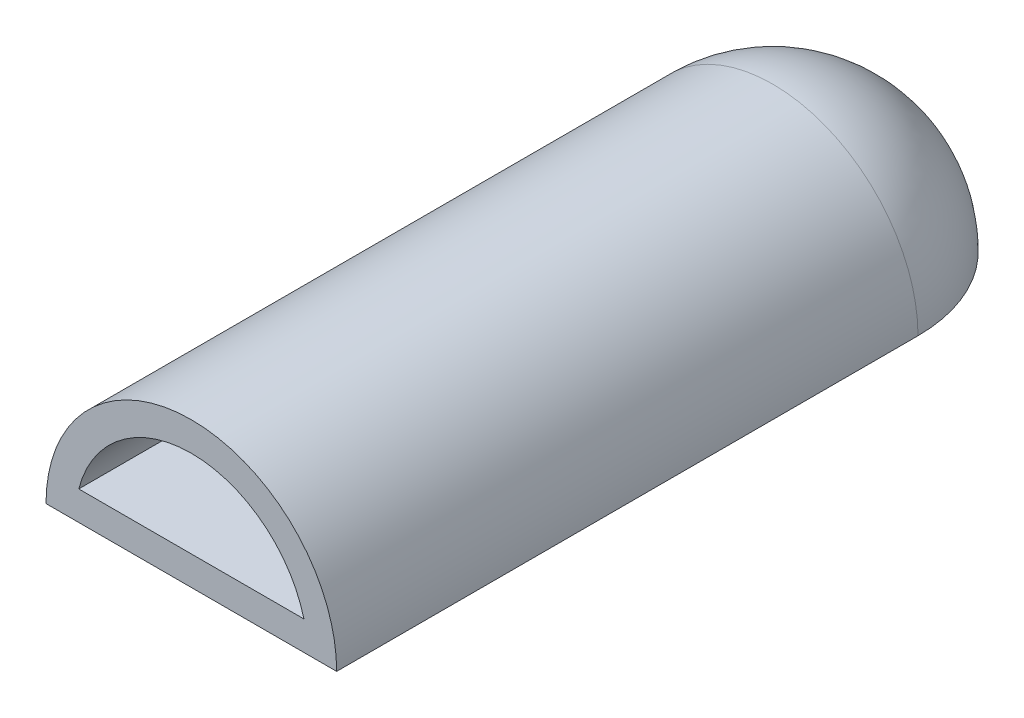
ISO-10303-21;
HEADER;
FILE_DESCRIPTION(('STEP AP214'),'2;1');
FILE_NAME('part.step','',(''),(''),'','','');
FILE_SCHEMA(('AUTOMOTIVE_DESIGN { 1 0 10303 214 1 1 1 1 }'));
ENDSEC;
DATA;
#1=APPLICATION_CONTEXT('core data for automotive mechanical design processes');
#2=APPLICATION_PROTOCOL_DEFINITION('international standard','automotive_design',2000,#1);
#3=PRODUCT_CONTEXT('',#1,'mechanical');
#4=PRODUCT('Part','Part','',(#3));
#5=PRODUCT_RELATED_PRODUCT_CATEGORY('part','',(#4));
#6=PRODUCT_DEFINITION_FORMATION('','',#4);
#7=PRODUCT_DEFINITION_CONTEXT('part definition',#1,'design');
#8=PRODUCT_DEFINITION('design','',#6,#7);
#9=PRODUCT_DEFINITION_SHAPE('','',#8);
#10=(LENGTH_UNIT() NAMED_UNIT(*) SI_UNIT(.MILLI.,.METRE.));
#11=(NAMED_UNIT(*) PLANE_ANGLE_UNIT() SI_UNIT($,.RADIAN.));
#12=(NAMED_UNIT(*) SI_UNIT($,.STERADIAN.) SOLID_ANGLE_UNIT());
#13=UNCERTAINTY_MEASURE_WITH_UNIT(LENGTH_MEASURE(1.E-05),#10,'distance_accuracy_value','');
#14=(GEOMETRIC_REPRESENTATION_CONTEXT(3) GLOBAL_UNCERTAINTY_ASSIGNED_CONTEXT((#13)) GLOBAL_UNIT_ASSIGNED_CONTEXT((#10,
#11,#12)) REPRESENTATION_CONTEXT('',''));
#15=CARTESIAN_POINT('',(0.,0.,0.));
#16=DIRECTION('',(0.,0.,1.));
#17=DIRECTION('',(1.,0.,0.));
#18=AXIS2_PLACEMENT_3D('',#15,#16,#17);
#19=CARTESIAN_POINT('',(0.,0.,100.));
#20=DIRECTION('',(0.,0.,-1.));
#21=DIRECTION('',(-1.,0.,0.));
#22=AXIS2_PLACEMENT_3D('',#19,#20,#21);
#23=PLANE('',#22);
#24=CARTESIAN_POINT('',(0.,0.,100.));
#25=DIRECTION('',(0.,0.,1.));
#26=DIRECTION('',(-1.,0.,0.));
#27=AXIS2_PLACEMENT_3D('',#24,#25,#26);
#28=CIRCLE('',#27,20.);
#29=CARTESIAN_POINT('',(20.,0.,100.));
#30=VERTEX_POINT('',#29);
#31=CARTESIAN_POINT('',(-20.,0.,100.));
#32=VERTEX_POINT('',#31);
#33=EDGE_CURVE('E87',#30,#32,#28,.T.);
#34=ORIENTED_EDGE('',*,*,#33,.T.);
#35=DIRECTION('',(1.,0.,0.));
#36=VECTOR('',#35,1.);
#37=CARTESIAN_POINT('',(-20.,0.,100.));
#38=LINE('',#37,#36);
#39=EDGE_CURVE('E112',#32,#30,#38,.T.);
#40=ORIENTED_EDGE('',*,*,#39,.T.);
#41=EDGE_LOOP('',(#34,#40));
#42=FACE_BOUND('',#41,.T.);
#43=CARTESIAN_POINT('',(0.,0.,100.));
#44=DIRECTION('',(0.,0.,-1.));
#45=DIRECTION('',(-1.,0.,0.));
#46=AXIS2_PLACEMENT_3D('',#43,#44,#45);
#47=CIRCLE('',#46,16.);
#48=CARTESIAN_POINT('',(15.4919333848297,4.,100.));
#49=VERTEX_POINT('',#48);
#50=CARTESIAN_POINT('',(-15.4919333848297,4.,100.));
#51=VERTEX_POINT('',#50);
#52=EDGE_CURVE('E104',#49,#51,#47,.F.);
#53=ORIENTED_EDGE('',*,*,#52,.F.);
#54=DIRECTION('',(1.,0.,0.));
#55=VECTOR('',#54,1.);
#56=CARTESIAN_POINT('',(0.,4.,100.));
#57=LINE('',#56,#55);
#58=EDGE_CURVE('E93',#51,#49,#57,.T.);
#59=ORIENTED_EDGE('',*,*,#58,.F.);
#60=EDGE_LOOP('',(#53,#59));
#61=FACE_BOUND('',#60,.T.);
#62=ADVANCED_FACE('F39',(#42,#61),#23,.F.);
#63=CARTESIAN_POINT('',(0.,0.,100.));
#64=DIRECTION('',(0.,0.,-1.));
#65=DIRECTION('',(-1.,0.,0.));
#66=AXIS2_PLACEMENT_3D('',#63,#64,#65);
#67=CYLINDRICAL_SURFACE('',#66,20.);
#68=DIRECTION('',(0.,0.,-1.));
#69=VECTOR('',#68,1.);
#70=CARTESIAN_POINT('',(20.,0.,100.));
#71=LINE('',#70,#69);
#72=CARTESIAN_POINT('',(20.,0.,20.));
#73=VERTEX_POINT('',#72);
#74=EDGE_CURVE('E115',#30,#73,#71,.T.);
#75=ORIENTED_EDGE('',*,*,#74,.T.);
#76=CARTESIAN_POINT('',(0.,0.,20.));
#77=DIRECTION('',(0.,0.,-1.));
#78=DIRECTION('',(-1.,0.,0.));
#79=AXIS2_PLACEMENT_3D('',#76,#77,#78);
#80=CIRCLE('',#79,20.);
#81=CARTESIAN_POINT('',(-20.,0.,20.));
#82=VERTEX_POINT('',#81);
#83=EDGE_CURVE('E122',#73,#82,#80,.F.);
#84=ORIENTED_EDGE('',*,*,#83,.T.);
#85=DIRECTION('',(0.,0.,-1.));
#86=VECTOR('',#85,1.);
#87=CARTESIAN_POINT('',(-20.,0.,100.));
#88=LINE('',#87,#86);
#89=EDGE_CURVE('E119',#32,#82,#88,.T.);
#90=ORIENTED_EDGE('',*,*,#89,.F.);
#91=ORIENTED_EDGE('',*,*,#33,.F.);
#92=EDGE_LOOP('',(#75,#84,#90,#91));
#93=FACE_BOUND('',#92,.T.);
#94=ADVANCED_FACE('F132',(#93),#67,.T.);
#95=CARTESIAN_POINT('',(-20.,0.,100.));
#96=DIRECTION('',(0.,1.,0.));
#97=DIRECTION('',(0.,0.,1.));
#98=AXIS2_PLACEMENT_3D('',#95,#96,#97);
#99=PLANE('',#98);
#100=ORIENTED_EDGE('',*,*,#89,.T.);
#101=CARTESIAN_POINT('',(0.,0.,20.));
#102=DIRECTION('',(0.,1.,0.));
#103=DIRECTION('',(0.,0.,1.));
#104=AXIS2_PLACEMENT_3D('',#101,#102,#103);
#105=CIRCLE('',#104,20.);
#106=CARTESIAN_POINT('',(0.,0.,0.));
#107=VERTEX_POINT('',#106);
#108=EDGE_CURVE('E11',#82,#107,#105,.F.);
#109=ORIENTED_EDGE('',*,*,#108,.T.);
#110=CARTESIAN_POINT('',(0.,0.,20.));
#111=DIRECTION('',(0.,1.,0.));
#112=DIRECTION('',(0.,0.,1.));
#113=AXIS2_PLACEMENT_3D('',#110,#111,#112);
#114=CIRCLE('',#113,20.);
#115=EDGE_CURVE('E48',#107,#73,#114,.F.);
#116=ORIENTED_EDGE('',*,*,#115,.T.);
#117=ORIENTED_EDGE('',*,*,#74,.F.);
#118=ORIENTED_EDGE('',*,*,#39,.F.);
#119=EDGE_LOOP('',(#100,#109,#116,#117,#118));
#120=FACE_BOUND('',#119,.T.);
#121=ADVANCED_FACE('F127',(#120),#99,.F.);
#122=CARTESIAN_POINT('',(0.,0.,20.));
#123=DIRECTION('',(0.,0.,-1.));
#124=DIRECTION('',(-1.,0.,0.));
#125=AXIS2_PLACEMENT_3D('',#122,#123,#124);
#126=SPHERICAL_SURFACE('',#125,20.);
#127=ORIENTED_EDGE('',*,*,#83,.F.);
#128=ORIENTED_EDGE('',*,*,#115,.F.);
#129=ORIENTED_EDGE('',*,*,#108,.F.);
#130=EDGE_LOOP('',(#127,#128,#129));
#131=FACE_BOUND('',#130,.T.);
#132=ADVANCED_FACE('F41',(#131),#126,.T.);
#133=CARTESIAN_POINT('',(0.,0.,100.));
#134=DIRECTION('',(0.,0.,-1.));
#135=DIRECTION('',(-1.,0.,0.));
#136=AXIS2_PLACEMENT_3D('',#133,#134,#135);
#137=CYLINDRICAL_SURFACE('',#136,16.);
#138=DIRECTION('',(0.,0.,-1.));
#139=VECTOR('',#138,1.);
#140=CARTESIAN_POINT('',(15.4919333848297,4.,100.));
#141=LINE('',#140,#139);
#142=CARTESIAN_POINT('',(15.4919333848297,4.,20.));
#143=VERTEX_POINT('',#142);
#144=EDGE_CURVE('E90',#49,#143,#141,.T.);
#145=ORIENTED_EDGE('',*,*,#144,.F.);
#146=ORIENTED_EDGE('',*,*,#52,.T.);
#147=DIRECTION('',(0.,0.,-1.));
#148=VECTOR('',#147,1.);
#149=CARTESIAN_POINT('',(-15.4919333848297,4.,100.));
#150=LINE('',#149,#148);
#151=CARTESIAN_POINT('',(-15.4919333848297,4.,20.));
#152=VERTEX_POINT('',#151);
#153=EDGE_CURVE('E55',#51,#152,#150,.T.);
#154=ORIENTED_EDGE('',*,*,#153,.T.);
#155=CARTESIAN_POINT('',(0.,0.,20.));
#156=DIRECTION('',(0.,0.,-1.));
#157=DIRECTION('',(-1.,0.,0.));
#158=AXIS2_PLACEMENT_3D('',#155,#156,#157);
#159=CIRCLE('',#158,16.);
#160=EDGE_CURVE('E85',#143,#152,#159,.F.);
#161=ORIENTED_EDGE('',*,*,#160,.F.);
#162=EDGE_LOOP('',(#145,#146,#154,#161));
#163=FACE_BOUND('',#162,.T.);
#164=ADVANCED_FACE('F98',(#163),#137,.F.);
#165=CARTESIAN_POINT('',(-20.,4.,100.));
#166=DIRECTION('',(0.,1.,0.));
#167=DIRECTION('',(0.,0.,1.));
#168=AXIS2_PLACEMENT_3D('',#165,#166,#167);
#169=PLANE('',#168);
#170=ORIENTED_EDGE('',*,*,#153,.F.);
#171=ORIENTED_EDGE('',*,*,#58,.T.);
#172=ORIENTED_EDGE('',*,*,#144,.T.);
#173=CARTESIAN_POINT('',(0.,4.,20.));
#174=DIRECTION('',(0.,1.,0.));
#175=DIRECTION('',(0.,0.,1.));
#176=AXIS2_PLACEMENT_3D('',#173,#174,#175);
#177=CIRCLE('',#176,15.4919333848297);
#178=EDGE_CURVE('E81',#152,#143,#177,.F.);
#179=ORIENTED_EDGE('',*,*,#178,.F.);
#180=EDGE_LOOP('',(#170,#171,#172,#179));
#181=FACE_BOUND('',#180,.T.);
#182=ADVANCED_FACE('F91',(#181),#169,.T.);
#183=CARTESIAN_POINT('',(0.,0.,20.));
#184=DIRECTION('',(0.,0.,-1.));
#185=DIRECTION('',(-1.,0.,0.));
#186=AXIS2_PLACEMENT_3D('',#183,#184,#185);
#187=SPHERICAL_SURFACE('',#186,16.);
#188=ORIENTED_EDGE('',*,*,#160,.T.);
#189=ORIENTED_EDGE('',*,*,#178,.T.);
#190=EDGE_LOOP('',(#188,#189));
#191=FACE_BOUND('',#190,.T.);
#192=ADVANCED_FACE('F83',(#191),#187,.F.);
#193=CLOSED_SHELL('',(#62,#94,#121,#132,#164,#182,#192));
#194=MANIFOLD_SOLID_BREP('B2',#193);
#195=ADVANCED_BREP_SHAPE_REPRESENTATION('',(#18,#194),#14);
#196=SHAPE_DEFINITION_REPRESENTATION(#9,#195);
ENDSEC;
END-ISO-10303-21;
